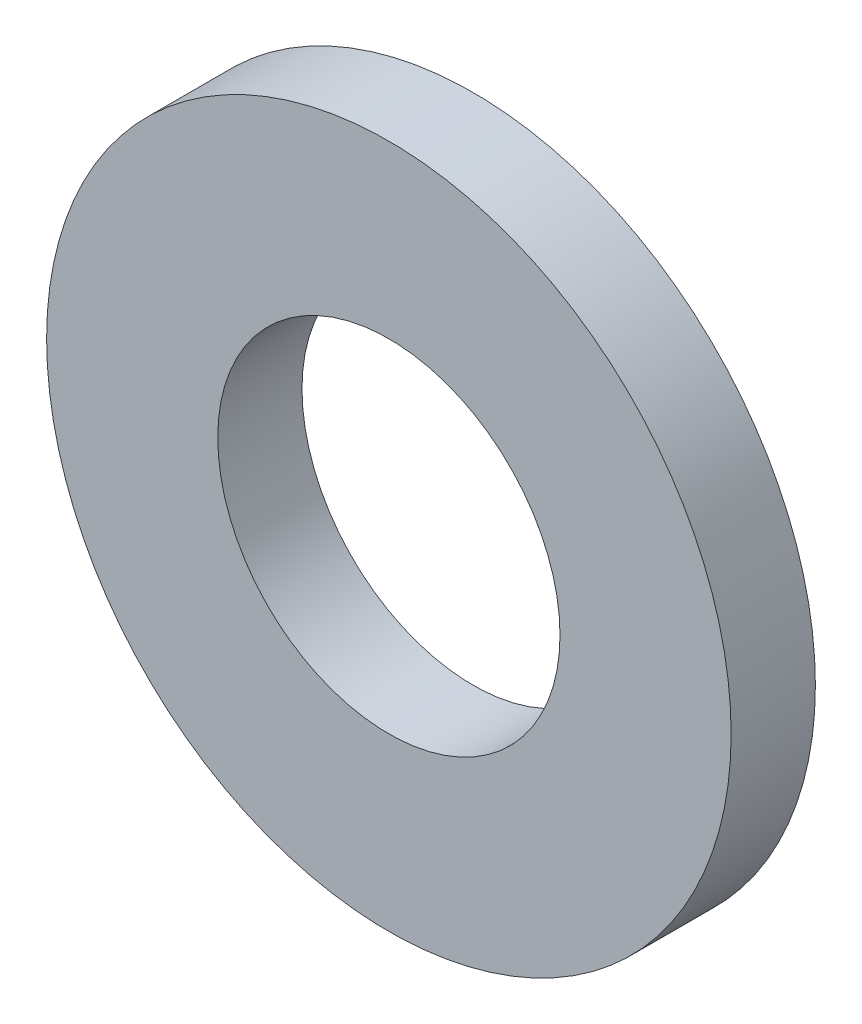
ISO-10303-21;
HEADER;
FILE_DESCRIPTION(('STEP AP214'),'2;1');
FILE_NAME('part.step','',(''),(''),'','','');
FILE_SCHEMA(('AUTOMOTIVE_DESIGN { 1 0 10303 214 1 1 1 1 }'));
ENDSEC;
DATA;
#1=APPLICATION_CONTEXT('core data for automotive mechanical design processes');
#2=APPLICATION_PROTOCOL_DEFINITION('international standard','automotive_design',2000,#1);
#3=PRODUCT_CONTEXT('',#1,'mechanical');
#4=PRODUCT('Part','Part','',(#3));
#5=PRODUCT_RELATED_PRODUCT_CATEGORY('part','',(#4));
#6=PRODUCT_DEFINITION_FORMATION('','',#4);
#7=PRODUCT_DEFINITION_CONTEXT('part definition',#1,'design');
#8=PRODUCT_DEFINITION('design','',#6,#7);
#9=PRODUCT_DEFINITION_SHAPE('','',#8);
#10=(LENGTH_UNIT() NAMED_UNIT(*) SI_UNIT(.MILLI.,.METRE.));
#11=(NAMED_UNIT(*) PLANE_ANGLE_UNIT() SI_UNIT($,.RADIAN.));
#12=(NAMED_UNIT(*) SI_UNIT($,.STERADIAN.) SOLID_ANGLE_UNIT());
#13=UNCERTAINTY_MEASURE_WITH_UNIT(LENGTH_MEASURE(1.E-05),#10,'distance_accuracy_value','');
#14=(GEOMETRIC_REPRESENTATION_CONTEXT(3) GLOBAL_UNCERTAINTY_ASSIGNED_CONTEXT((#13)) GLOBAL_UNIT_ASSIGNED_CONTEXT((#10,
#11,#12)) REPRESENTATION_CONTEXT('',''));
#15=CARTESIAN_POINT('',(0.,0.,0.));
#16=DIRECTION('',(0.,0.,1.));
#17=DIRECTION('',(1.,0.,0.));
#18=AXIS2_PLACEMENT_3D('',#15,#16,#17);
#19=CARTESIAN_POINT('',(0.,0.,0.8));
#20=DIRECTION('',(0.,0.,1.));
#21=DIRECTION('',(1.,0.,0.));
#22=AXIS2_PLACEMENT_3D('',#19,#20,#21);
#23=PLANE('',#22);
#24=CARTESIAN_POINT('',(0.,0.,0.8));
#25=DIRECTION('',(0.,0.,1.));
#26=DIRECTION('',(1.,0.,0.));
#27=AXIS2_PLACEMENT_3D('',#24,#25,#26);
#28=CIRCLE('',#27,3.25);
#29=CARTESIAN_POINT('',(3.25,0.,0.8));
#30=VERTEX_POINT('',#29);
#31=EDGE_CURVE('E10',#30,#30,#28,.T.);
#32=ORIENTED_EDGE('',*,*,#31,.T.);
#33=EDGE_LOOP('',(#32));
#34=FACE_BOUND('',#33,.T.);
#35=CARTESIAN_POINT('',(0.,0.,0.8));
#36=DIRECTION('',(0.,0.,1.));
#37=DIRECTION('',(1.,0.,0.));
#38=AXIS2_PLACEMENT_3D('',#35,#36,#37);
#39=CIRCLE('',#38,1.625);
#40=CARTESIAN_POINT('',(1.625,0.,0.8));
#41=VERTEX_POINT('',#40);
#42=EDGE_CURVE('E36',#41,#41,#39,.T.);
#43=ORIENTED_EDGE('',*,*,#42,.F.);
#44=EDGE_LOOP('',(#43));
#45=FACE_BOUND('',#44,.T.);
#46=ADVANCED_FACE('F25',(#34,#45),#23,.T.);
#47=CARTESIAN_POINT('',(0.,0.,0.));
#48=DIRECTION('',(0.,0.,1.));
#49=DIRECTION('',(1.,0.,0.));
#50=AXIS2_PLACEMENT_3D('',#47,#48,#49);
#51=PLANE('',#50);
#52=CARTESIAN_POINT('',(0.,0.,0.));
#53=DIRECTION('',(0.,0.,1.));
#54=DIRECTION('',(1.,0.,0.));
#55=AXIS2_PLACEMENT_3D('',#52,#53,#54);
#56=CIRCLE('',#55,3.25);
#57=CARTESIAN_POINT('',(3.25,0.,0.));
#58=VERTEX_POINT('',#57);
#59=EDGE_CURVE('E32',#58,#58,#56,.T.);
#60=ORIENTED_EDGE('',*,*,#59,.F.);
#61=EDGE_LOOP('',(#60));
#62=FACE_BOUND('',#61,.T.);
#63=CARTESIAN_POINT('',(0.,0.,0.));
#64=DIRECTION('',(0.,0.,1.));
#65=DIRECTION('',(1.,0.,0.));
#66=AXIS2_PLACEMENT_3D('',#63,#64,#65);
#67=CIRCLE('',#66,1.625);
#68=CARTESIAN_POINT('',(1.625,0.,0.));
#69=VERTEX_POINT('',#68);
#70=EDGE_CURVE('E40',#69,#69,#67,.T.);
#71=ORIENTED_EDGE('',*,*,#70,.T.);
#72=EDGE_LOOP('',(#71));
#73=FACE_BOUND('',#72,.T.);
#74=ADVANCED_FACE('F46',(#62,#73),#51,.F.);
#75=CARTESIAN_POINT('',(0.,0.,0.8));
#76=DIRECTION('',(0.,0.,-1.));
#77=DIRECTION('',(-1.,0.,0.));
#78=AXIS2_PLACEMENT_3D('',#75,#76,#77);
#79=CYLINDRICAL_SURFACE('',#78,3.25);
#80=ORIENTED_EDGE('',*,*,#31,.F.);
#81=EDGE_LOOP('',(#80));
#82=FACE_BOUND('',#81,.T.);
#83=ORIENTED_EDGE('',*,*,#59,.T.);
#84=EDGE_LOOP('',(#83));
#85=FACE_BOUND('',#84,.T.);
#86=ADVANCED_FACE('F27',(#82,#85),#79,.T.);
#87=CARTESIAN_POINT('',(0.,0.,0.8));
#88=DIRECTION('',(0.,0.,-1.));
#89=DIRECTION('',(-1.,0.,0.));
#90=AXIS2_PLACEMENT_3D('',#87,#88,#89);
#91=CYLINDRICAL_SURFACE('',#90,1.625);
#92=ORIENTED_EDGE('',*,*,#42,.T.);
#93=EDGE_LOOP('',(#92));
#94=FACE_BOUND('',#93,.T.);
#95=ORIENTED_EDGE('',*,*,#70,.F.);
#96=EDGE_LOOP('',(#95));
#97=FACE_BOUND('',#96,.T.);
#98=ADVANCED_FACE('F48',(#94,#97),#91,.F.);
#99=CLOSED_SHELL('',(#46,#74,#86,#98));
#100=MANIFOLD_SOLID_BREP('B2',#99);
#101=ADVANCED_BREP_SHAPE_REPRESENTATION('',(#18,#100),#14);
#102=SHAPE_DEFINITION_REPRESENTATION(#9,#101);
ENDSEC;
END-ISO-10303-21;
